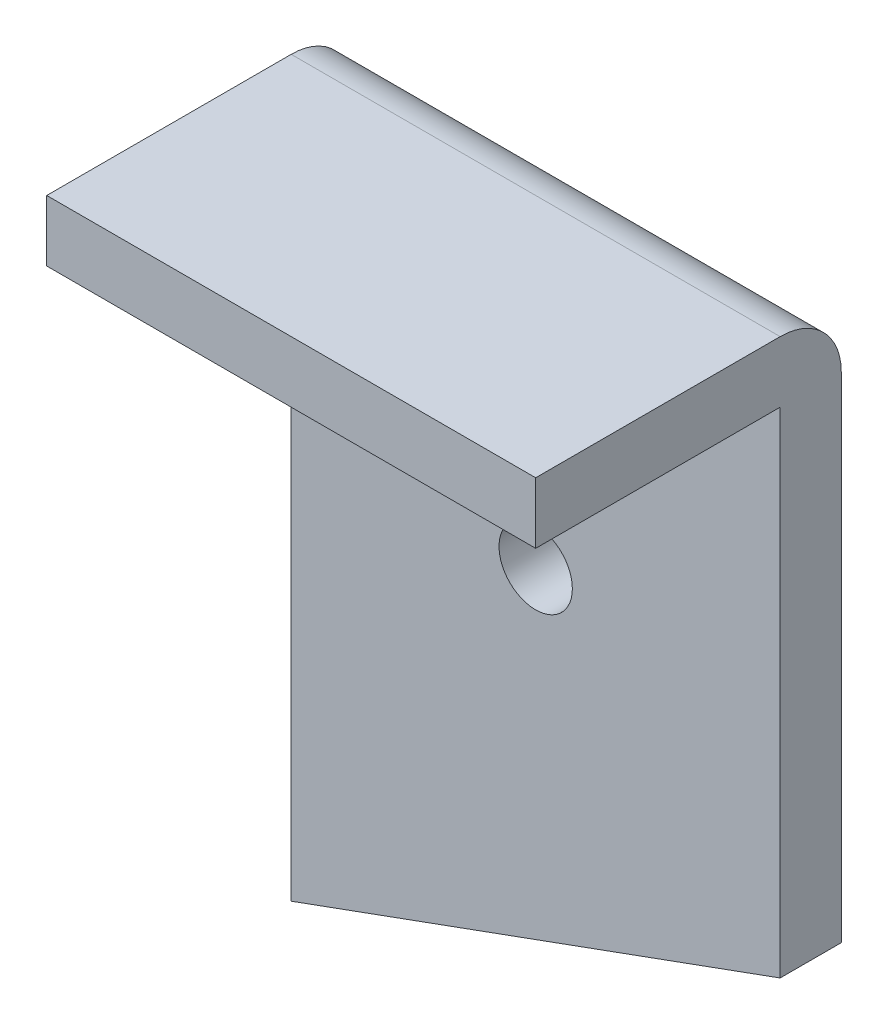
from build123d import *

# Parameters (mm, degrees)
ESQUISSE1_R      = 6
EXTRUSION1_DEPTH = 10
ESQUISSE2_W      = 80
ESQUISSE2_H      = 10
EXTRUSION2_DEPTH = 40
CONG_1_R         = 10


with BuildPart() as part:
    # Esquisse1 → Extrusion1 (new body)
    with BuildSketch(Plane.XY):
        Polygon((0, 0), (80, 0), (80, -90.882381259), (0, -120), align=None)
        with Locations((40, -52.720595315)):
            Circle(ESQUISSE1_R, mode=Mode.SUBTRACT)
    extrude(amount=EXTRUSION1_DEPTH)

    # Esquisse2 → Extrusion2 (add)
    with BuildSketch(Plane.XY.offset(10)):
        with Locations((40, -5)):
            Rectangle(ESQUISSE2_W, ESQUISSE2_H)
    extrude(amount=EXTRUSION2_DEPTH)

    # Cong_1
    cong_1_edges = [part.edges().sort_by_distance(p)[0] for p in [
        (40, 0, 0),
    ]]
    fillet(cong_1_edges, radius=CONG_1_R)


solid = part.part
